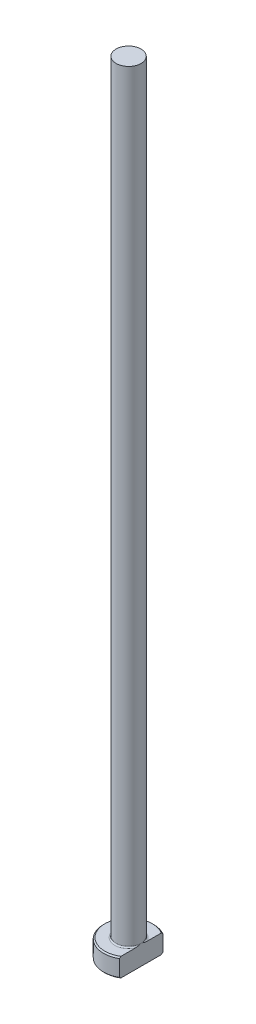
ISO-10303-21;
HEADER;
FILE_DESCRIPTION(('STEP AP214'),'2;1');
FILE_NAME('part.step','',(''),(''),'','','');
FILE_SCHEMA(('AUTOMOTIVE_DESIGN { 1 0 10303 214 1 1 1 1 }'));
ENDSEC;
DATA;
#1=APPLICATION_CONTEXT('core data for automotive mechanical design processes');
#2=APPLICATION_PROTOCOL_DEFINITION('international standard','automotive_design',2000,#1);
#3=PRODUCT_CONTEXT('',#1,'mechanical');
#4=PRODUCT('Part','Part','',(#3));
#5=PRODUCT_RELATED_PRODUCT_CATEGORY('part','',(#4));
#6=PRODUCT_DEFINITION_FORMATION('','',#4);
#7=PRODUCT_DEFINITION_CONTEXT('part definition',#1,'design');
#8=PRODUCT_DEFINITION('design','',#6,#7);
#9=PRODUCT_DEFINITION_SHAPE('','',#8);
#10=(LENGTH_UNIT() NAMED_UNIT(*) SI_UNIT(.MILLI.,.METRE.));
#11=(NAMED_UNIT(*) PLANE_ANGLE_UNIT() SI_UNIT($,.RADIAN.));
#12=(NAMED_UNIT(*) SI_UNIT($,.STERADIAN.) SOLID_ANGLE_UNIT());
#13=UNCERTAINTY_MEASURE_WITH_UNIT(LENGTH_MEASURE(1.E-05),#10,'distance_accuracy_value','');
#14=(GEOMETRIC_REPRESENTATION_CONTEXT(3) GLOBAL_UNCERTAINTY_ASSIGNED_CONTEXT((#13)) GLOBAL_UNIT_ASSIGNED_CONTEXT((#10,
#11,#12)) REPRESENTATION_CONTEXT('',''));
#15=CARTESIAN_POINT('',(0.,0.,0.));
#16=DIRECTION('',(0.,0.,1.));
#17=DIRECTION('',(1.,0.,0.));
#18=AXIS2_PLACEMENT_3D('',#15,#16,#17);
#19=CARTESIAN_POINT('',(0.,0.,0.));
#20=DIRECTION('',(0.,-1.,0.));
#21=DIRECTION('',(0.,0.,-1.));
#22=AXIS2_PLACEMENT_3D('',#19,#20,#21);
#23=PLANE('',#22);
#24=CARTESIAN_POINT('',(0.,0.,0.));
#25=DIRECTION('',(0.,-1.,0.));
#26=DIRECTION('',(0.,0.,-1.));
#27=AXIS2_PLACEMENT_3D('',#24,#25,#26);
#28=CIRCLE('',#27,3.79999999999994);
#29=CARTESIAN_POINT('',(1.99999999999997,0.,3.23109888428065));
#30=VERTEX_POINT('',#29);
#31=CARTESIAN_POINT('',(1.99999999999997,0.,-3.23109888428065));
#32=VERTEX_POINT('',#31);
#33=EDGE_CURVE('E98',#30,#32,#28,.T.);
#34=ORIENTED_EDGE('',*,*,#33,.T.);
#35=DIRECTION('',(0.,0.,1.));
#36=VECTOR('',#35,1.);
#37=CARTESIAN_POINT('',(1.99999999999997,0.,-3.46410161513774));
#38=LINE('',#37,#36);
#39=EDGE_CURVE('E83',#32,#30,#38,.T.);
#40=ORIENTED_EDGE('',*,*,#39,.T.);
#41=EDGE_LOOP('',(#34,#40));
#42=FACE_BOUND('',#41,.T.);
#43=ADVANCED_FACE('F32',(#42),#23,.T.);
#44=CARTESIAN_POINT('',(0.,259.958771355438,0.));
#45=DIRECTION('',(0.,1.,0.));
#46=DIRECTION('',(0.,0.,1.));
#47=AXIS2_PLACEMENT_3D('',#44,#45,#46);
#48=CYLINDRICAL_SURFACE('',#47,3.99999999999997);
#49=CARTESIAN_POINT('',(0.,2.79999999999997,0.));
#50=DIRECTION('',(0.,1.,0.));
#51=DIRECTION('',(0.,0.,1.));
#52=AXIS2_PLACEMENT_3D('',#49,#50,#51);
#53=CIRCLE('',#52,3.99999999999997);
#54=CARTESIAN_POINT('',(1.99999999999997,2.79999999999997,3.46410161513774));
#55=VERTEX_POINT('',#54);
#56=CARTESIAN_POINT('',(1.99999999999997,2.79999999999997,-3.46410161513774));
#57=VERTEX_POINT('',#56);
#58=EDGE_CURVE('E104',#55,#57,#53,.F.);
#59=ORIENTED_EDGE('',*,*,#58,.T.);
#60=DIRECTION('',(0.,-1.,0.));
#61=VECTOR('',#60,1.);
#62=CARTESIAN_POINT('',(1.99999999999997,125.,-3.46410161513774));
#63=LINE('',#62,#61);
#64=CARTESIAN_POINT('',(1.99999999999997,0.200000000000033,-3.46410161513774));
#65=VERTEX_POINT('',#64);
#66=EDGE_CURVE('E183',#57,#65,#63,.T.);
#67=ORIENTED_EDGE('',*,*,#66,.T.);
#68=CARTESIAN_POINT('',(0.,0.200000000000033,0.));
#69=DIRECTION('',(0.,-1.,0.));
#70=DIRECTION('',(0.,0.,-1.));
#71=AXIS2_PLACEMENT_3D('',#68,#69,#70);
#72=CIRCLE('',#71,3.99999999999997);
#73=CARTESIAN_POINT('',(1.99999999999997,0.200000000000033,3.46410161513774));
#74=VERTEX_POINT('',#73);
#75=EDGE_CURVE('E100',#65,#74,#72,.F.);
#76=ORIENTED_EDGE('',*,*,#75,.T.);
#77=DIRECTION('',(0.,-1.,0.));
#78=VECTOR('',#77,1.);
#79=CARTESIAN_POINT('',(1.99999999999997,125.,3.46410161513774));
#80=LINE('',#79,#78);
#81=EDGE_CURVE('E93',#55,#74,#80,.T.);
#82=ORIENTED_EDGE('',*,*,#81,.F.);
#83=EDGE_LOOP('',(#59,#67,#76,#82));
#84=FACE_BOUND('',#83,.T.);
#85=ADVANCED_FACE('F158',(#84),#48,.T.);
#86=CARTESIAN_POINT('',(-3.99999999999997,3.,0.));
#87=DIRECTION('',(0.,1.,0.));
#88=DIRECTION('',(0.,0.,1.));
#89=AXIS2_PLACEMENT_3D('',#86,#87,#88);
#90=PLANE('',#89);
#91=CARTESIAN_POINT('',(0.,3.,0.));
#92=DIRECTION('',(0.,1.,0.));
#93=DIRECTION('',(0.,0.,1.));
#94=AXIS2_PLACEMENT_3D('',#91,#92,#93);
#95=CIRCLE('',#94,3.79999999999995);
#96=CARTESIAN_POINT('',(1.99999999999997,3.,-3.23109888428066));
#97=VERTEX_POINT('',#96);
#98=CARTESIAN_POINT('',(1.99999999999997,3.,3.23109888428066));
#99=VERTEX_POINT('',#98);
#100=EDGE_CURVE('E178',#97,#99,#95,.T.);
#101=ORIENTED_EDGE('',*,*,#100,.T.);
#102=DIRECTION('',(0.,0.,-1.));
#103=VECTOR('',#102,1.);
#104=CARTESIAN_POINT('',(1.99999999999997,3.,0.));
#105=LINE('',#104,#103);
#106=CARTESIAN_POINT('',(1.99999999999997,2.99999999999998,0.916515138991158));
#107=VERTEX_POINT('',#106);
#108=EDGE_CURVE('E57',#99,#107,#105,.T.);
#109=ORIENTED_EDGE('',*,*,#108,.T.);
#110=CARTESIAN_POINT('',(0.,3.,0.));
#111=DIRECTION('',(0.,1.,0.));
#112=DIRECTION('',(0.,0.,1.));
#113=AXIS2_PLACEMENT_3D('',#110,#111,#112);
#114=CIRCLE('',#113,2.19999999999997);
#115=CARTESIAN_POINT('',(1.99999999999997,2.99999999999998,-0.9165151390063));
#116=VERTEX_POINT('',#115);
#117=EDGE_CURVE('E107',#107,#116,#114,.F.);
#118=ORIENTED_EDGE('',*,*,#117,.T.);
#119=EDGE_CURVE('E136',#116,#97,#105,.T.);
#120=ORIENTED_EDGE('',*,*,#119,.T.);
#121=EDGE_LOOP('',(#101,#109,#118,#120));
#122=FACE_BOUND('',#121,.T.);
#123=ADVANCED_FACE('F147',(#122),#90,.T.);
#124=CARTESIAN_POINT('',(0.,3.,0.));
#125=DIRECTION('',(0.,-1.,0.));
#126=DIRECTION('',(0.,0.,-1.));
#127=AXIS2_PLACEMENT_3D('',#124,#125,#126);
#128=CONICAL_SURFACE('',#127,3.79999999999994,0.785398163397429);
#129=ORIENTED_EDGE('',*,*,#58,.F.);
#130=CARTESIAN_POINT('',(1.99999999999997,-1.08095467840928,7.62295524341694));
#131=CARTESIAN_POINT('',(1.99999999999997,-0.913887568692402,7.45022392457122));
#132=CARTESIAN_POINT('',(1.99999999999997,-0.746999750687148,7.27731861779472));
#133=CARTESIAN_POINT('',(1.99999999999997,-0.413688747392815,6.93105655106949));
#134=CARTESIAN_POINT('',(1.99999999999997,-0.247265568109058,6.75769978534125));
#135=CARTESIAN_POINT('',(1.99999999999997,0.0850908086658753,6.41034692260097));
#136=CARTESIAN_POINT('',(1.99999999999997,0.251023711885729,6.23635054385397));
#137=CARTESIAN_POINT('',(1.99999999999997,0.582155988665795,5.88766284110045));
#138=CARTESIAN_POINT('',(1.99999999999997,0.747355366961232,5.71297152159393));
#139=CARTESIAN_POINT('',(1.99999999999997,1.07353855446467,5.36616839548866));
#140=CARTESIAN_POINT('',(1.99999999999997,1.23454099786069,5.194074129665));
#141=CARTESIAN_POINT('',(1.99999999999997,1.5553410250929,4.84876663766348));
#142=CARTESIAN_POINT('',(1.99999999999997,1.71513861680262,4.67555341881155));
#143=CARTESIAN_POINT('',(1.99999999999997,2.03306183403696,4.32766569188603));
#144=CARTESIAN_POINT('',(1.99999999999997,2.19118781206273,4.15299150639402));
#145=CARTESIAN_POINT('',(1.99999999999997,2.50513944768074,3.80159134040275));
#146=CARTESIAN_POINT('',(1.99999999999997,2.6609651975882,3.62486544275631));
#147=CARTESIAN_POINT('',(1.99999999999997,2.90974646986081,3.33722425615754));
#148=CARTESIAN_POINT('',(1.99999999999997,3.00376148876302,3.22722645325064));
#149=CARTESIAN_POINT('',(1.99999999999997,3.19011825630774,3.00579987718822));
#150=CARTESIAN_POINT('',(1.99999999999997,3.28245983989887,2.89437096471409));
#151=CARTESIAN_POINT('',(1.99999999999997,3.46586188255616,2.66849662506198));
#152=CARTESIAN_POINT('',(1.99999999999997,3.55689849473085,2.55403176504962));
#153=CARTESIAN_POINT('',(1.99999999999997,3.73578809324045,2.32266819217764));
#154=CARTESIAN_POINT('',(1.99999999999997,3.82364184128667,2.20577007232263));
#155=CARTESIAN_POINT('',(1.99999999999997,3.99612756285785,1.96688707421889));
#156=CARTESIAN_POINT('',(1.99999999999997,4.08069035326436,1.84485190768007));
#157=CARTESIAN_POINT('',(1.99999999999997,4.24300264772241,1.59599329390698));
#158=CARTESIAN_POINT('',(1.99999999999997,4.32074277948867,1.46916359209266));
#159=CARTESIAN_POINT('',(1.99999999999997,4.42869763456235,1.27510066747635));
#160=CARTESIAN_POINT('',(1.99999999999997,4.46305374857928,1.21018943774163));
#161=CARTESIAN_POINT('',(1.99999999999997,4.52837146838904,1.07868835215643));
#162=CARTESIAN_POINT('',(1.99999999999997,4.55933245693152,1.01209819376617));
#163=CARTESIAN_POINT('',(1.99999999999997,4.64566860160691,0.809894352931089));
#164=CARTESIAN_POINT('',(1.99999999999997,4.69478214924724,0.67136024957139));
#165=CARTESIAN_POINT('',(1.99999999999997,4.74794829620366,0.463657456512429));
#166=CARTESIAN_POINT('',(1.99999999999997,4.76205065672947,0.397033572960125));
#167=CARTESIAN_POINT('',(1.99999999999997,4.7839037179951,0.262728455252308));
#168=CARTESIAN_POINT('',(1.99999999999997,4.79165498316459,0.195047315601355));
#169=CARTESIAN_POINT('',(1.99999999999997,4.80025690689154,0.0594528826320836));
#170=CARTESIAN_POINT('',(1.99999999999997,4.80112894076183,-0.00845903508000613));
#171=CARTESIAN_POINT('',(1.99999999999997,4.79596585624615,-0.144020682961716));
#172=CARTESIAN_POINT('',(1.99999999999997,4.7899301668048,-0.211670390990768));
#173=CARTESIAN_POINT('',(1.99999999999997,4.77145363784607,-0.34548399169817));
#174=CARTESIAN_POINT('',(1.99999999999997,4.75906777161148,-0.411655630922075));
#175=CARTESIAN_POINT('',(1.99999999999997,4.72866360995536,-0.542678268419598));
#176=CARTESIAN_POINT('',(1.99999999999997,4.71064463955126,-0.607529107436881));
#177=CARTESIAN_POINT('',(1.99999999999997,4.66972939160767,-0.736064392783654));
#178=CARTESIAN_POINT('',(1.99999999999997,4.6468056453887,-0.799739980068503));
#179=CARTESIAN_POINT('',(1.99999999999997,4.59700147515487,-0.925489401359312));
#180=CARTESIAN_POINT('',(1.99999999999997,4.57012185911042,-0.98756355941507));
#181=CARTESIAN_POINT('',(1.99999999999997,4.48443518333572,-1.17209020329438));
#182=CARTESIAN_POINT('',(1.99999999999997,4.42077407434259,-1.29228210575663));
#183=CARTESIAN_POINT('',(1.99999999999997,4.28502644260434,-1.52785770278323));
#184=CARTESIAN_POINT('',(1.99999999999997,4.21292931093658,-1.64323509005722));
#185=CARTESIAN_POINT('',(1.99999999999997,4.0628151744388,-1.87069387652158));
#186=CARTESIAN_POINT('',(1.99999999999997,3.98477595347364,-1.98276048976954));
#187=CARTESIAN_POINT('',(1.99999999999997,3.82481971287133,-2.20397837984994));
#188=CARTESIAN_POINT('',(1.99999999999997,3.74290465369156,-2.31313108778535));
#189=CARTESIAN_POINT('',(1.99999999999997,3.57517222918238,-2.5306854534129));
#190=CARTESIAN_POINT('',(1.99999999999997,3.48931769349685,-2.63905831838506));
#191=CARTESIAN_POINT('',(1.99999999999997,3.31548151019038,-2.85409686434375));
#192=CARTESIAN_POINT('',(1.99999999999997,3.22749963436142,-2.96076236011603));
#193=CARTESIAN_POINT('',(1.99999999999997,3.05015030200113,-3.17249211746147));
#194=CARTESIAN_POINT('',(1.99999999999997,2.96078672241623,-3.27755963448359));
#195=CARTESIAN_POINT('',(1.99999999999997,2.78082366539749,-3.48663191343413));
#196=CARTESIAN_POINT('',(1.99999999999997,2.69022416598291,-3.59063665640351));
#197=CARTESIAN_POINT('',(1.99999999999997,2.4479673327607,-3.86612439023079));
#198=CARTESIAN_POINT('',(1.99999999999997,2.29545972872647,-4.03685912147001));
#199=CARTESIAN_POINT('',(1.99999999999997,1.98858070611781,-4.37664803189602));
#200=CARTESIAN_POINT('',(1.99999999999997,1.8342092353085,-4.54570216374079));
#201=CARTESIAN_POINT('',(1.99999999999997,1.52396102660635,-4.88271638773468));
#202=CARTESIAN_POINT('',(1.99999999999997,1.3680830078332,-5.05067529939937));
#203=CARTESIAN_POINT('',(1.99999999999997,1.05530513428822,-5.38563883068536));
#204=CARTESIAN_POINT('',(1.99999999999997,0.898405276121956,-5.55264344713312));
#205=CARTESIAN_POINT('',(1.99999999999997,0.590290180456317,-5.87905385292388));
#206=CARTESIAN_POINT('',(1.99999999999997,0.439106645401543,-6.03848959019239));
#207=CARTESIAN_POINT('',(1.99999999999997,0.136164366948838,-6.356814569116));
#208=CARTESIAN_POINT('',(1.99999999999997,-0.0155943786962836,-6.51570380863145));
#209=CARTESIAN_POINT('',(1.99999999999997,-0.31940498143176,-6.83286192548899));
#210=CARTESIAN_POINT('',(1.99999999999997,-0.471456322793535,-6.99113129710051));
#211=CARTESIAN_POINT('',(1.99999999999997,-0.77593964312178,-7.30730102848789));
#212=CARTESIAN_POINT('',(1.99999999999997,-0.928371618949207,-7.46520139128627));
#213=CARTESIAN_POINT('',(1.99999999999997,-1.08095467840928,-7.62295524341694));
#214=B_SPLINE_CURVE_WITH_KNOTS('',3,(#130,#131,#132,#133,#134,#135,#136,#137,#138,#139,#140,
#141,#142,#143,#144,#145,#146,#147,#148,#149,#150,#151,#152,#153,#154,#155,#156,#157,#158,#159,
#160,#161,#162,#163,#164,#165,#166,#167,#168,#169,#170,#171,#172,#173,#174,#175,#176,#177,#178,
#179,#180,#181,#182,#183,#184,#185,#186,#187,#188,#189,#190,#191,#192,#193,#194,#195,#196,#197,
#198,#199,#200,#201,#202,#203,#204,#205,#206,#207,#208,#209,#210,#211,#212,#213),.UNSPECIFIED.,
.F.,.F.,(4,2,2,2,2,2,2,2,2,2,2,2,2,2,2,2,2,2,2,2,2,2,2,2,2,2,2,2,2,2,2,2,2,2,2,2,2,2,2,2,2,4),
(0.,0.720921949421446,1.44185317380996,2.1631532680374,2.88444869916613,3.59144103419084,
4.29842874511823,5.005264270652,5.712071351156,6.14616174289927,6.58029471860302,
7.01901494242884,7.45762947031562,7.90290456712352,8.34878206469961,8.56901415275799,
8.7892862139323,9.22814472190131,9.43219512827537,9.63622739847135,9.8396254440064,
10.0430403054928,10.2447232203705,10.4464303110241,10.6492980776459,10.8521244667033,
11.259558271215,11.6675100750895,12.0770700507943,12.4864250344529,12.901167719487,
13.3159550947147,13.7297367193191,14.1435257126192,14.8302935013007,15.5170805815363,
16.2045145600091,16.8919508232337,17.5511045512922,18.2102608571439,18.86868195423,
19.5270976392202),.UNSPECIFIED.);
#215=EDGE_CURVE('E135',#55,#99,#214,.T.);
#216=ORIENTED_EDGE('',*,*,#215,.T.);
#217=ORIENTED_EDGE('',*,*,#100,.F.);
#218=EDGE_CURVE('E127',#97,#57,#214,.T.);
#219=ORIENTED_EDGE('',*,*,#218,.T.);
#220=EDGE_LOOP('',(#129,#216,#217,#219));
#221=FACE_BOUND('',#220,.T.);
#222=ADVANCED_FACE('F143',(#221),#128,.T.);
#223=CARTESIAN_POINT('',(0.,0.200000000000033,0.));
#224=DIRECTION('',(0.,1.,0.));
#225=DIRECTION('',(0.,0.,1.));
#226=AXIS2_PLACEMENT_3D('',#223,#224,#225);
#227=CONICAL_SURFACE('',#226,3.99999999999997,0.785398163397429);
#228=ORIENTED_EDGE('',*,*,#75,.F.);
#229=CARTESIAN_POINT('',(1.99999999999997,4.08095467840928,-7.62295524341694));
#230=CARTESIAN_POINT('',(1.99999999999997,3.91388756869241,-7.45022392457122));
#231=CARTESIAN_POINT('',(1.99999999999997,3.74699975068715,-7.27731861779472));
#232=CARTESIAN_POINT('',(1.99999999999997,3.41368874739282,-6.9310565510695));
#233=CARTESIAN_POINT('',(1.99999999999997,3.24726556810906,-6.75769978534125));
#234=CARTESIAN_POINT('',(1.99999999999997,2.91490919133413,-6.41034692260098));
#235=CARTESIAN_POINT('',(1.99999999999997,2.74897628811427,-6.23635054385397));
#236=CARTESIAN_POINT('',(1.99999999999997,2.41784401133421,-5.88766284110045));
#237=CARTESIAN_POINT('',(1.99999999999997,2.25264463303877,-5.71297152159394));
#238=CARTESIAN_POINT('',(1.99999999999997,1.92646144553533,-5.36616839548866));
#239=CARTESIAN_POINT('',(1.99999999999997,1.76545900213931,-5.19407412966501));
#240=CARTESIAN_POINT('',(1.99999999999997,1.4446589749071,-4.84876663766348));
#241=CARTESIAN_POINT('',(1.99999999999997,1.28486138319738,-4.67555341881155));
#242=CARTESIAN_POINT('',(1.99999999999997,0.966938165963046,-4.32766569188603));
#243=CARTESIAN_POINT('',(1.99999999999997,0.808812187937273,-4.15299150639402));
#244=CARTESIAN_POINT('',(1.99999999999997,0.494860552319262,-3.80159134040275));
#245=CARTESIAN_POINT('',(1.99999999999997,0.339034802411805,-3.62486544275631));
#246=CARTESIAN_POINT('',(1.99999999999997,0.0902535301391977,-3.33722425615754));
#247=CARTESIAN_POINT('',(1.99999999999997,-0.00376148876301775,-3.22722645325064));
#248=CARTESIAN_POINT('',(1.99999999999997,-0.190118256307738,-3.00579987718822));
#249=CARTESIAN_POINT('',(1.99999999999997,-0.282459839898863,-2.89437096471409));
#250=CARTESIAN_POINT('',(1.99999999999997,-0.465861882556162,-2.66849662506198));
#251=CARTESIAN_POINT('',(1.99999999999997,-0.556898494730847,-2.55403176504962));
#252=CARTESIAN_POINT('',(1.99999999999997,-0.735788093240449,-2.32266819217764));
#253=CARTESIAN_POINT('',(1.99999999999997,-0.823641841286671,-2.20577007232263));
#254=CARTESIAN_POINT('',(1.99999999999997,-0.996127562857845,-1.96688707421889));
#255=CARTESIAN_POINT('',(1.99999999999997,-1.08069035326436,-1.84485190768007));
#256=CARTESIAN_POINT('',(1.99999999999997,-1.2430026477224,-1.59599329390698));
#257=CARTESIAN_POINT('',(1.99999999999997,-1.32074277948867,-1.46916359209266));
#258=CARTESIAN_POINT('',(1.99999999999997,-1.42869763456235,-1.27510066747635));
#259=CARTESIAN_POINT('',(1.99999999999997,-1.46305374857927,-1.21018943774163));
#260=CARTESIAN_POINT('',(1.99999999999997,-1.52837146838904,-1.07868835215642));
#261=CARTESIAN_POINT('',(1.99999999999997,-1.55933245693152,-1.01209819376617));
#262=CARTESIAN_POINT('',(1.99999999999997,-1.64566860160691,-0.809894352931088));
#263=CARTESIAN_POINT('',(1.99999999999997,-1.69478214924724,-0.671360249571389));
#264=CARTESIAN_POINT('',(1.99999999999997,-1.74794829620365,-0.463657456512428));
#265=CARTESIAN_POINT('',(1.99999999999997,-1.76205065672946,-0.397033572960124));
#266=CARTESIAN_POINT('',(1.99999999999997,-1.7839037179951,-0.262728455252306));
#267=CARTESIAN_POINT('',(1.99999999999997,-1.79165498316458,-0.195047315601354));
#268=CARTESIAN_POINT('',(1.99999999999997,-1.80025690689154,-0.0594528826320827));
#269=CARTESIAN_POINT('',(1.99999999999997,-1.80112894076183,0.00845903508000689));
#270=CARTESIAN_POINT('',(1.99999999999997,-1.79596585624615,0.144020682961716));
#271=CARTESIAN_POINT('',(1.99999999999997,-1.7899301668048,0.211670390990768));
#272=CARTESIAN_POINT('',(1.99999999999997,-1.77145363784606,0.345483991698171));
#273=CARTESIAN_POINT('',(1.99999999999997,-1.75906777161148,0.411655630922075));
#274=CARTESIAN_POINT('',(1.99999999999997,-1.72866360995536,0.542678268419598));
#275=CARTESIAN_POINT('',(1.99999999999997,-1.71064463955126,0.60752910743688));
#276=CARTESIAN_POINT('',(1.99999999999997,-1.66972939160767,0.736064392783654));
#277=CARTESIAN_POINT('',(1.99999999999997,-1.6468056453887,0.799739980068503));
#278=CARTESIAN_POINT('',(1.99999999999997,-1.59700147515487,0.925489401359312));
#279=CARTESIAN_POINT('',(1.99999999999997,-1.57012185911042,0.98756355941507));
#280=CARTESIAN_POINT('',(1.99999999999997,-1.48443518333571,1.17209020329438));
#281=CARTESIAN_POINT('',(1.99999999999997,-1.42077407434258,1.29228210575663));
#282=CARTESIAN_POINT('',(1.99999999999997,-1.28502644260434,1.52785770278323));
#283=CARTESIAN_POINT('',(1.99999999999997,-1.21292931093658,1.64323509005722));
#284=CARTESIAN_POINT('',(1.99999999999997,-1.0628151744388,1.87069387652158));
#285=CARTESIAN_POINT('',(1.99999999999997,-0.984775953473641,1.98276048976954));
#286=CARTESIAN_POINT('',(1.99999999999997,-0.824819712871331,2.20397837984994));
#287=CARTESIAN_POINT('',(1.99999999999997,-0.742904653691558,2.31313108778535));
#288=CARTESIAN_POINT('',(1.99999999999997,-0.575172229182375,2.53068545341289));
#289=CARTESIAN_POINT('',(1.99999999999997,-0.489317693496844,2.63905831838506));
#290=CARTESIAN_POINT('',(1.99999999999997,-0.315481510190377,2.85409686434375));
#291=CARTESIAN_POINT('',(1.99999999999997,-0.227499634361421,2.96076236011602));
#292=CARTESIAN_POINT('',(1.99999999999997,-0.0501503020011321,3.17249211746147));
#293=CARTESIAN_POINT('',(1.99999999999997,0.0392132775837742,3.27755963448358));
#294=CARTESIAN_POINT('',(1.99999999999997,0.219176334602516,3.48663191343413));
#295=CARTESIAN_POINT('',(1.99999999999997,0.309775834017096,3.59063665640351));
#296=CARTESIAN_POINT('',(1.99999999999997,0.552032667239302,3.86612439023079));
#297=CARTESIAN_POINT('',(1.99999999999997,0.704540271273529,4.03685912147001));
#298=CARTESIAN_POINT('',(1.99999999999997,1.01141929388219,4.37664803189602));
#299=CARTESIAN_POINT('',(1.99999999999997,1.1657907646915,4.54570216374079));
#300=CARTESIAN_POINT('',(1.99999999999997,1.47603897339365,4.88271638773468));
#301=CARTESIAN_POINT('',(1.99999999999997,1.63191699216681,5.05067529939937));
#302=CARTESIAN_POINT('',(1.99999999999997,1.94469486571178,5.38563883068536));
#303=CARTESIAN_POINT('',(1.99999999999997,2.10159472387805,5.55264344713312));
#304=CARTESIAN_POINT('',(1.99999999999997,2.40970981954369,5.87905385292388));
#305=CARTESIAN_POINT('',(1.99999999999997,2.56089335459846,6.03848959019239));
#306=CARTESIAN_POINT('',(1.99999999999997,2.86383563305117,6.356814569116));
#307=CARTESIAN_POINT('',(1.99999999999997,3.01559437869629,6.51570380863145));
#308=CARTESIAN_POINT('',(1.99999999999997,3.31940498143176,6.83286192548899));
#309=CARTESIAN_POINT('',(1.99999999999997,3.47145632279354,6.99113129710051));
#310=CARTESIAN_POINT('',(1.99999999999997,3.77593964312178,7.30730102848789));
#311=CARTESIAN_POINT('',(1.99999999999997,3.92837161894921,7.46520139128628));
#312=CARTESIAN_POINT('',(1.99999999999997,4.08095467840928,7.62295524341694));
#313=B_SPLINE_CURVE_WITH_KNOTS('',3,(#229,#230,#231,#232,#233,#234,#235,#236,#237,#238,#239,
#240,#241,#242,#243,#244,#245,#246,#247,#248,#249,#250,#251,#252,#253,#254,#255,#256,#257,#258,
#259,#260,#261,#262,#263,#264,#265,#266,#267,#268,#269,#270,#271,#272,#273,#274,#275,#276,#277,
#278,#279,#280,#281,#282,#283,#284,#285,#286,#287,#288,#289,#290,#291,#292,#293,#294,#295,#296,
#297,#298,#299,#300,#301,#302,#303,#304,#305,#306,#307,#308,#309,#310,#311,#312),.UNSPECIFIED.,
.F.,.F.,(4,2,2,2,2,2,2,2,2,2,2,2,2,2,2,2,2,2,2,2,2,2,2,2,2,2,2,2,2,2,2,2,2,2,2,2,2,2,2,2,2,4),
(0.,0.720921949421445,1.44185317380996,2.1631532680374,2.88444869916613,3.59144103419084,
4.29842874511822,5.005264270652,5.71207135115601,6.14616174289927,6.58029471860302,
7.01901494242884,7.45762947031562,7.90290456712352,8.34878206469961,8.56901415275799,
8.7892862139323,9.22814472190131,9.43219512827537,9.63622739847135,9.8396254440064,
10.0430403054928,10.2447232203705,10.4464303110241,10.6492980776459,10.8521244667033,
11.259558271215,11.6675100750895,12.0770700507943,12.4864250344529,12.901167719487,
13.3159550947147,13.7297367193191,14.1435257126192,14.8302935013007,15.5170805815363,
16.2045145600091,16.8919508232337,17.5511045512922,18.2102608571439,18.86868195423,
19.5270976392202),.UNSPECIFIED.);
#314=EDGE_CURVE('E86',#65,#32,#313,.T.);
#315=ORIENTED_EDGE('',*,*,#314,.T.);
#316=ORIENTED_EDGE('',*,*,#33,.F.);
#317=EDGE_CURVE('E89',#30,#74,#313,.T.);
#318=ORIENTED_EDGE('',*,*,#317,.T.);
#319=EDGE_LOOP('',(#228,#315,#316,#318));
#320=FACE_BOUND('',#319,.T.);
#321=ADVANCED_FACE('F97',(#320),#227,.T.);
#322=CARTESIAN_POINT('',(0.,3.19999999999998,0.));
#323=DIRECTION('',(0.,1.,0.));
#324=DIRECTION('',(0.,0.,1.));
#325=AXIS2_PLACEMENT_3D('',#322,#323,#324);
#326=TOROIDAL_SURFACE('',#325,2.19999999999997,0.2);
#327=CARTESIAN_POINT('',(1.99999999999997,3.19999999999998,0.));
#328=CARTESIAN_POINT('',(1.99999999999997,3.20000050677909,1.13930257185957E-10));
#329=CARTESIAN_POINT('',(1.99999999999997,3.20000101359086,-1.46766790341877E-07));
#330=CARTESIAN_POINT('',(1.99999999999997,3.20000197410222,-5.82067439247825E-07));
#331=CARTESIAN_POINT('',(1.99999999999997,3.20000242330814,-8.77873003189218E-07));
#332=CARTESIAN_POINT('',(1.99999999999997,3.20000333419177,-1.58424512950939E-06));
#333=CARTESIAN_POINT('',(1.99999999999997,3.20000378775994,-2.00534281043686E-06));
#334=CARTESIAN_POINT('',(1.99999999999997,3.20000462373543,-2.89558838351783E-06));
#335=CARTESIAN_POINT('',(1.99999999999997,3.20000500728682,-3.3637232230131E-06));
#336=CARTESIAN_POINT('',(1.99999999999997,3.20000636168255,-5.10887545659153E-06));
#337=CARTESIAN_POINT('',(1.99999999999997,3.2000072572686,-6.44597273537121E-06));
#338=CARTESIAN_POINT('',(1.99999999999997,3.20000879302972,-9.14926709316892E-06));
#339=CARTESIAN_POINT('',(1.99999999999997,3.20000944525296,-1.05089714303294E-05));
#340=CARTESIAN_POINT('',(1.99999999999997,3.20001204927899,-1.60555879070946E-05));
#341=CARTESIAN_POINT('',(1.99999999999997,3.20001390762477,-2.02908746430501E-05));
#342=CARTESIAN_POINT('',(1.99999999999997,3.20001676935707,-2.84438492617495E-05));
#343=CARTESIAN_POINT('',(1.99999999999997,3.2000178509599,-3.23343257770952E-05));
#344=CARTESIAN_POINT('',(1.99999999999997,3.20002551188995,-6.06027142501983E-05));
#345=CARTESIAN_POINT('',(1.99999999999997,3.20003111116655,-8.51991843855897E-05));
#346=CARTESIAN_POINT('',(1.99999999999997,3.20005559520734,-0.000181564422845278));
#347=CARTESIAN_POINT('',(1.99999999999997,3.20007914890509,-0.00025209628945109));
#348=CARTESIAN_POINT('',(1.99999999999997,3.20017002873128,-0.000529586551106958));
#349=CARTESIAN_POINT('',(1.99999999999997,3.20023415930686,-0.000737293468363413));
#350=CARTESIAN_POINT('',(1.99999999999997,3.20048926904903,-0.00155657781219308));
#351=CARTESIAN_POINT('',(1.99999999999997,3.20068414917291,-0.00216722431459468));
#352=CARTESIAN_POINT('',(1.99999999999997,3.20148805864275,-0.00469384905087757));
#353=CARTESIAN_POINT('',(1.99999999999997,3.20209226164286,-0.00661098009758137));
#354=CARTESIAN_POINT('',(1.99999999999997,3.20822779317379,-0.026069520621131));
#355=CARTESIAN_POINT('',(1.99999999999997,3.21378174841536,-0.0436057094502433));
#356=CARTESIAN_POINT('',(1.99999999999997,3.22462834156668,-0.0780127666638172));
#357=CARTESIAN_POINT('',(1.99999999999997,3.2299227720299,-0.0948831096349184));
#358=CARTESIAN_POINT('',(1.99999999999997,3.24110477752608,-0.130713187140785));
#359=CARTESIAN_POINT('',(1.99999999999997,3.24698536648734,-0.149675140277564));
#360=CARTESIAN_POINT('',(1.99999999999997,3.2586983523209,-0.187834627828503));
#361=CARTESIAN_POINT('',(1.99999999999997,3.26452957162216,-0.207032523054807));
#362=CARTESIAN_POINT('',(1.99999999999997,3.27861584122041,-0.254071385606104));
#363=CARTESIAN_POINT('',(1.99999999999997,3.28678835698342,-0.281937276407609));
#364=CARTESIAN_POINT('',(1.99999999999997,3.30249503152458,-0.337115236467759));
#365=CARTESIAN_POINT('',(1.99999999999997,3.31003989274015,-0.36442425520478));
#366=CARTESIAN_POINT('',(1.99999999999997,3.32554795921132,-0.422841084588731));
#367=CARTESIAN_POINT('',(1.99999999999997,3.33343288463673,-0.453970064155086));
#368=CARTESIAN_POINT('',(1.99999999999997,3.34833120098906,-0.516667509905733));
#369=CARTESIAN_POINT('',(1.99999999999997,3.3553379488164,-0.548237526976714));
#370=CARTESIAN_POINT('',(1.99999999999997,3.37554978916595,-0.647984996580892));
#371=CARTESIAN_POINT('',(1.99999999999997,3.38665117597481,-0.716635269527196));
#372=CARTESIAN_POINT('',(1.99999999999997,3.39785773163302,-0.832445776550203));
#373=CARTESIAN_POINT('',(1.99999999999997,3.40036304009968,-0.879345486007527));
#374=CARTESIAN_POINT('',(1.99999999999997,3.3997602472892,-0.94923898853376));
#375=CARTESIAN_POINT('',(1.99999999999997,3.39886048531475,-0.972248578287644));
#376=CARTESIAN_POINT('',(1.99999999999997,3.39534463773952,-1.01812773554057));
#377=CARTESIAN_POINT('',(1.99999999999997,3.39273014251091,-1.04099741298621));
#378=CARTESIAN_POINT('',(1.99999999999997,3.38623968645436,-1.08102660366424));
#379=CARTESIAN_POINT('',(1.99999999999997,3.38280841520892,-1.09825717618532));
#380=CARTESIAN_POINT('',(1.99999999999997,3.37442567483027,-1.13243508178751));
#381=CARTESIAN_POINT('',(1.99999999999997,3.36946777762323,-1.14938089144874));
#382=CARTESIAN_POINT('',(1.99999999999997,3.35764172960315,-1.18276398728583));
#383=CARTESIAN_POINT('',(1.99999999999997,3.3507581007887,-1.19919590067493));
#384=CARTESIAN_POINT('',(1.99999999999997,3.33462082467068,-1.23083581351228));
#385=CARTESIAN_POINT('',(1.99999999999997,3.32537783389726,-1.24604892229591));
#386=CARTESIAN_POINT('',(1.99999999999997,3.30929159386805,-1.26715296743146));
#387=CARTESIAN_POINT('',(1.99999999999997,3.30356769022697,-1.27389441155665));
#388=CARTESIAN_POINT('',(1.99999999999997,3.29128925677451,-1.28659894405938));
#389=CARTESIAN_POINT('',(1.99999999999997,3.28473413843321,-1.2925614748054));
#390=CARTESIAN_POINT('',(1.99999999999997,3.27066594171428,-1.30346436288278));
#391=CARTESIAN_POINT('',(1.99999999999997,3.26314132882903,-1.30839014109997));
#392=CARTESIAN_POINT('',(1.99999999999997,3.24727957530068,-1.31668687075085));
#393=CARTESIAN_POINT('',(1.99999999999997,3.23894498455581,-1.32006252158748));
#394=CARTESIAN_POINT('',(1.99999999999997,3.22424089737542,-1.3241557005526));
#395=CARTESIAN_POINT('',(1.99999999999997,3.21800630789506,-1.32536112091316));
#396=CARTESIAN_POINT('',(1.99999999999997,3.20542266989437,-1.32669615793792));
#397=CARTESIAN_POINT('',(1.99999999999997,3.19907368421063,-1.32682634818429));
#398=CARTESIAN_POINT('',(1.99999999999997,3.18645152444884,-1.32599950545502));
#399=CARTESIAN_POINT('',(1.99999999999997,3.18017831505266,-1.32504300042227));
#400=CARTESIAN_POINT('',(1.99999999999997,3.16787181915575,-1.32212308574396));
#401=CARTESIAN_POINT('',(1.99999999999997,3.16183869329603,-1.3201590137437));
#402=CARTESIAN_POINT('',(1.99999999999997,3.14844260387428,-1.3146656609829));
#403=CARTESIAN_POINT('',(1.99999999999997,3.14119825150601,-1.31084826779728));
#404=CARTESIAN_POINT('',(1.99999999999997,3.12742328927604,-1.30209252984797));
#405=CARTESIAN_POINT('',(1.99999999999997,3.12089414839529,-1.2971519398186));
#406=CARTESIAN_POINT('',(1.99999999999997,3.10554761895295,-1.28382084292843));
#407=CARTESIAN_POINT('',(1.99999999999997,3.09717242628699,-1.27492468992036));
#408=CARTESIAN_POINT('',(1.99999999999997,3.08188323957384,-1.25597903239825));
#409=CARTESIAN_POINT('',(1.99999999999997,3.07497120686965,-1.24592800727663));
#410=CARTESIAN_POINT('',(1.99999999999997,3.05771073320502,-1.21734573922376));
#411=CARTESIAN_POINT('',(1.99999999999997,3.04862251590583,-1.19806017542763));
#412=CARTESIAN_POINT('',(1.99999999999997,3.03323781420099,-1.15830155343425));
#413=CARTESIAN_POINT('',(1.99999999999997,3.02696471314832,-1.13782009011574));
#414=CARTESIAN_POINT('',(1.99999999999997,3.0165915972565,-1.09607450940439));
#415=CARTESIAN_POINT('',(1.99999999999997,3.0125177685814,-1.07480405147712));
#416=CARTESIAN_POINT('',(1.99999999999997,3.00618909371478,-1.03196822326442));
#417=CARTESIAN_POINT('',(1.99999999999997,3.00393768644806,-1.01040237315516));
#418=CARTESIAN_POINT('',(1.99999999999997,2.99950887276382,-0.94694819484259));
#419=CARTESIAN_POINT('',(1.99999999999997,2.99937097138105,-0.904921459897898));
#420=CARTESIAN_POINT('',(1.99999999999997,3.00391139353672,-0.800067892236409));
#421=CARTESIAN_POINT('',(1.99999999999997,3.01103947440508,-0.7373784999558));
#422=CARTESIAN_POINT('',(1.99999999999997,3.0310998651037,-0.611444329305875));
#423=CARTESIAN_POINT('',(1.99999999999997,3.04417074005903,-0.548223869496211));
#424=CARTESIAN_POINT('',(1.99999999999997,3.06920011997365,-0.442888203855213));
#425=CARTESIAN_POINT('',(1.99999999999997,3.08016343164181,-0.40052705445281));
#426=CARTESIAN_POINT('',(1.99999999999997,3.10315303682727,-0.316588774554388));
#427=CARTESIAN_POINT('',(1.99999999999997,3.11516655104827,-0.275008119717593));
#428=CARTESIAN_POINT('',(1.99999999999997,3.13853403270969,-0.196672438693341));
#429=CARTESIAN_POINT('',(1.99999999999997,3.14981294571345,-0.159894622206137));
#430=CARTESIAN_POINT('',(1.99999999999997,3.17316886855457,-0.0849211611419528));
#431=CARTESIAN_POINT('',(1.99999999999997,3.1852595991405,-0.0467297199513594));
#432=CARTESIAN_POINT('',(1.99999999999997,3.19790869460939,-0.00660765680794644));
#433=CARTESIAN_POINT('',(1.99999999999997,3.19851400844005,-0.00468723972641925));
#434=CARTESIAN_POINT('',(1.99999999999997,3.19931818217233,-0.00215985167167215));
#435=CARTESIAN_POINT('',(1.99999999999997,3.19951225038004,-0.00155173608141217));
#436=CARTESIAN_POINT('',(1.99999999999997,3.19976637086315,-0.000735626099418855));
#437=CARTESIAN_POINT('',(1.99999999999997,3.19983030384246,-0.000528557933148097));
#438=CARTESIAN_POINT('',(1.99999999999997,3.1999209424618,-0.000251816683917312));
#439=CARTESIAN_POINT('',(1.99999999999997,3.19994446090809,-0.000181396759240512));
#440=CARTESIAN_POINT('',(1.99999999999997,3.19996891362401,-8.51622335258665E-05));
#441=CARTESIAN_POINT('',(1.99999999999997,3.19997450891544,-6.05824642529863E-05));
#442=CARTESIAN_POINT('',(1.99999999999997,3.19998216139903,-3.23308900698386E-05));
#443=CARTESIAN_POINT('',(1.99999999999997,3.19998324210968,-2.8441435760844E-05));
#444=CARTESIAN_POINT('',(1.99999999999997,3.19998610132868,-2.02904708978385E-05));
#445=CARTESIAN_POINT('',(1.99999999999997,3.19998795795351,-1.60561197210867E-05));
#446=CARTESIAN_POINT('',(1.99999999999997,3.19999055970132,-1.05104410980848E-05));
#447=CARTESIAN_POINT('',(1.99999999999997,3.19999121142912,-9.15081310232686E-06));
#448=CARTESIAN_POINT('',(1.99999999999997,3.19999274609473,-6.44758190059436E-06));
#449=CARTESIAN_POINT('',(1.99999999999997,3.19999364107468,-5.11046368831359E-06));
#450=CARTESIAN_POINT('',(1.99999999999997,3.19999499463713,-3.36517633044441E-06));
#451=CARTESIAN_POINT('',(1.99999999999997,3.19999537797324,-2.89697952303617E-06));
#452=CARTESIAN_POINT('',(1.99999999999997,3.19999621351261,-2.00657123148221E-06));
#453=CARTESIAN_POINT('',(1.99999999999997,3.19999666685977,-1.58537194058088E-06));
#454=CARTESIAN_POINT('',(1.99999999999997,3.19999757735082,-8.78757202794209E-07));
#455=CARTESIAN_POINT('',(1.99999999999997,3.19999802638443,-5.82817881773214E-07));
#456=CARTESIAN_POINT('',(1.99999999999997,3.19999898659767,-1.47186730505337E-07));
#457=CARTESIAN_POINT('',(1.99999999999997,3.1999994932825,-1.13916400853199E-10));
#458=CARTESIAN_POINT('',(1.99999999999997,3.19999999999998,0.));
#459=B_SPLINE_CURVE_WITH_KNOTS('',3,(#327,#328,#329,#330,#331,#332,#333,#334,#335,#336,#337,
#338,#339,#340,#341,#342,#343,#344,#345,#346,#347,#348,#349,#350,#351,#352,#353,#354,#355,#356,
#357,#358,#359,#360,#361,#362,#363,#364,#365,#366,#367,#368,#369,#370,#371,#372,#373,#374,#375,
#376,#377,#378,#379,#380,#381,#382,#383,#384,#385,#386,#387,#388,#389,#390,#391,#392,#393,#394,
#395,#396,#397,#398,#399,#400,#401,#402,#403,#404,#405,#406,#407,#408,#409,#410,#411,#412,#413,
#414,#415,#416,#417,#418,#419,#420,#421,#422,#423,#424,#425,#426,#427,#428,#429,#430,#431,#432,
#433,#434,#435,#436,#437,#438,#439,#440,#441,#442,#443,#444,#445,#446,#447,#448,#449,#450,#451,
#452,#453,#454,#455,#456,#457,#458),.UNSPECIFIED.,.T.,.F.,(4,2,2,2,2,2,2,2,2,2,2,2,2,2,2,2,2,2,
2,2,2,2,2,2,2,2,2,2,2,2,2,2,2,2,2,2,2,2,2,2,2,2,2,2,2,2,2,2,2,2,2,2,2,2,2,2,2,2,2,2,2,2,2,2,2,
4),(0.,1.5236988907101E-06,3.13175187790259E-06,4.97933886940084E-06,6.79332734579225E-06,
1.1600592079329E-05,1.61211192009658E-05,2.99630987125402E-05,4.20611843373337E-05,
0.000117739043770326,0.000340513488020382,0.000992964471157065,0.00291555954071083,
0.00894623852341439,0.0641278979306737,0.117173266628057,0.176731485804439,0.236923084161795,
0.324038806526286,0.409031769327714,0.50535329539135,0.602364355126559,0.810598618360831,
0.951214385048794,1.0202479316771,1.08921754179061,1.14187257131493,1.19475241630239,
1.24807013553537,1.30115116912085,1.32762610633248,1.35411989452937,1.38096446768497,
1.40772711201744,1.42669285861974,1.44564848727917,1.46459491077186,1.48355380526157,
1.50798338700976,1.5324622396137,1.56891061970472,1.60540755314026,1.66900939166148,
1.73313017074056,1.79799846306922,1.86298887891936,1.98877684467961,2.17764082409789,
2.37115413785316,2.50240556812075,2.632237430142,2.74764208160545,2.86781494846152,
2.87385601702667,2.87577064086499,2.87642108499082,2.87664350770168,2.87671913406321,
2.87673122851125,2.87674506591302,2.87674958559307,2.87675439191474,2.87675620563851,
2.87675805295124,2.87675966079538,2.87676118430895),.UNSPECIFIED.);
#460=CARTESIAN_POINT('',(1.99999999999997,3.19999999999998,0.));
#461=VERTEX_POINT('',#460);
#462=EDGE_CURVE('E11',#116,#461,#459,.T.);
#463=ORIENTED_EDGE('',*,*,#462,.F.);
#464=ORIENTED_EDGE('',*,*,#117,.F.);
#465=CARTESIAN_POINT('',(1.99999999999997,3.19999999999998,0.));
#466=CARTESIAN_POINT('',(1.99999999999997,3.19999949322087,-1.13930327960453E-10));
#467=CARTESIAN_POINT('',(1.99999999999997,3.1999989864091,1.46766790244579E-07));
#468=CARTESIAN_POINT('',(1.99999999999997,3.19999802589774,5.82067439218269E-07));
#469=CARTESIAN_POINT('',(1.99999999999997,3.19999757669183,8.77873003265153E-07));
#470=CARTESIAN_POINT('',(1.99999999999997,3.19999666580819,1.58424512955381E-06));
#471=CARTESIAN_POINT('',(1.99999999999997,3.19999621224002,2.00534281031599E-06));
#472=CARTESIAN_POINT('',(1.99999999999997,3.19999537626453,2.89558838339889E-06));
#473=CARTESIAN_POINT('',(1.99999999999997,3.19999499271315,3.36372322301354E-06));
#474=CARTESIAN_POINT('',(1.99999999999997,3.19999363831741,5.10887545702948E-06));
#475=CARTESIAN_POINT('',(1.99999999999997,3.19999274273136,6.44597273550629E-06));
#476=CARTESIAN_POINT('',(1.99999999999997,3.19999120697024,9.14926709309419E-06));
#477=CARTESIAN_POINT('',(1.99999999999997,3.199990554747,1.05089714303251E-05));
#478=CARTESIAN_POINT('',(1.99999999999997,3.19998795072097,1.60555879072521E-05));
#479=CARTESIAN_POINT('',(1.99999999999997,3.1999860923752,2.02908746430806E-05));
#480=CARTESIAN_POINT('',(1.99999999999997,3.19998323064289,2.84438492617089E-05));
#481=CARTESIAN_POINT('',(1.99999999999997,3.19998214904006,3.23343257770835E-05));
#482=CARTESIAN_POINT('',(1.99999999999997,3.19997448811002,6.06027142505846E-05));
#483=CARTESIAN_POINT('',(1.99999999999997,3.19996888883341,8.51991843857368E-05));
#484=CARTESIAN_POINT('',(1.99999999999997,3.19994440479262,0.000181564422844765));
#485=CARTESIAN_POINT('',(1.99999999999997,3.19992085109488,0.000252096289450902));
#486=CARTESIAN_POINT('',(1.99999999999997,3.19982997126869,0.000529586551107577));
#487=CARTESIAN_POINT('',(1.99999999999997,3.1997658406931,0.000737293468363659));
#488=CARTESIAN_POINT('',(1.99999999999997,3.19951073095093,0.00155657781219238));
#489=CARTESIAN_POINT('',(1.99999999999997,3.19931585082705,0.0021672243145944));
#490=CARTESIAN_POINT('',(1.99999999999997,3.19851194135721,0.00469384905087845));
#491=CARTESIAN_POINT('',(1.99999999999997,3.1979077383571,0.00661098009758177));
#492=CARTESIAN_POINT('',(1.99999999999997,3.19177220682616,0.0260695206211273));
#493=CARTESIAN_POINT('',(1.99999999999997,3.1862182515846,0.0436057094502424));
#494=CARTESIAN_POINT('',(1.99999999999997,3.17537165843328,0.0780127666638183));
#495=CARTESIAN_POINT('',(1.99999999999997,3.17007722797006,0.0948831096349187));
#496=CARTESIAN_POINT('',(1.99999999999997,3.15889522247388,0.130713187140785));
#497=CARTESIAN_POINT('',(1.99999999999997,3.15301463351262,0.149675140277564));
#498=CARTESIAN_POINT('',(1.99999999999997,3.14130164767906,0.187834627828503));
#499=CARTESIAN_POINT('',(1.99999999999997,3.1354704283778,0.207032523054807));
#500=CARTESIAN_POINT('',(1.99999999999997,3.12138415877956,0.254071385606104));
#501=CARTESIAN_POINT('',(1.99999999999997,3.11321164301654,0.281937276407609));
#502=CARTESIAN_POINT('',(1.99999999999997,3.09750496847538,0.337115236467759));
#503=CARTESIAN_POINT('',(1.99999999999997,3.08996010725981,0.36442425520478));
#504=CARTESIAN_POINT('',(1.99999999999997,3.07445204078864,0.422841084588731));
#505=CARTESIAN_POINT('',(1.99999999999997,3.06656711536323,0.453970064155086));
#506=CARTESIAN_POINT('',(1.99999999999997,3.0516687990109,0.516667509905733));
#507=CARTESIAN_POINT('',(1.99999999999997,3.04466205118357,0.548237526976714));
#508=CARTESIAN_POINT('',(1.99999999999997,3.02445021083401,0.647984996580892));
#509=CARTESIAN_POINT('',(1.99999999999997,3.01334882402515,0.716635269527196));
#510=CARTESIAN_POINT('',(1.99999999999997,3.00214226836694,0.832445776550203));
#511=CARTESIAN_POINT('',(1.99999999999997,2.99963695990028,0.879345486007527));
#512=CARTESIAN_POINT('',(1.99999999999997,3.00023975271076,0.94923898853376));
#513=CARTESIAN_POINT('',(1.99999999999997,3.00113951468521,0.972248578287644));
#514=CARTESIAN_POINT('',(1.99999999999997,3.00465536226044,1.01812773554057));
#515=CARTESIAN_POINT('',(1.99999999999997,3.00726985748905,1.04099741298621));
#516=CARTESIAN_POINT('',(1.99999999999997,3.0137603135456,1.08102660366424));
#517=CARTESIAN_POINT('',(1.99999999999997,3.01719158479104,1.09825717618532));
#518=CARTESIAN_POINT('',(1.99999999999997,3.02557432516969,1.13243508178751));
#519=CARTESIAN_POINT('',(1.99999999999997,3.03053222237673,1.14938089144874));
#520=CARTESIAN_POINT('',(1.99999999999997,3.04235827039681,1.18276398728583));
#521=CARTESIAN_POINT('',(1.99999999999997,3.04924189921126,1.19919590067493));
#522=CARTESIAN_POINT('',(1.99999999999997,3.06537917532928,1.23083581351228));
#523=CARTESIAN_POINT('',(1.99999999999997,3.0746221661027,1.24604892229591));
#524=CARTESIAN_POINT('',(1.99999999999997,3.09070840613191,1.26715296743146));
#525=CARTESIAN_POINT('',(1.99999999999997,3.09643230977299,1.27389441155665));
#526=CARTESIAN_POINT('',(1.99999999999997,3.10871074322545,1.28659894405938));
#527=CARTESIAN_POINT('',(1.99999999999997,3.11526586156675,1.2925614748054));
#528=CARTESIAN_POINT('',(1.99999999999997,3.12933405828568,1.30346436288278));
#529=CARTESIAN_POINT('',(1.99999999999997,3.13685867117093,1.30839014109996));
#530=CARTESIAN_POINT('',(1.99999999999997,3.15272042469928,1.31668687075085));
#531=CARTESIAN_POINT('',(1.99999999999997,3.16105501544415,1.32006252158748));
#532=CARTESIAN_POINT('',(1.99999999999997,3.17575910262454,1.3241557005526));
#533=CARTESIAN_POINT('',(1.99999999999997,3.1819936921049,1.32536112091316));
#534=CARTESIAN_POINT('',(1.99999999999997,3.1945773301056,1.32669615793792));
#535=CARTESIAN_POINT('',(1.99999999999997,3.20092631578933,1.32682634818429));
#536=CARTESIAN_POINT('',(1.99999999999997,3.21354847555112,1.32599950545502));
#537=CARTESIAN_POINT('',(1.99999999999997,3.2198216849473,1.32504300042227));
#538=CARTESIAN_POINT('',(1.99999999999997,3.23212818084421,1.32212308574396));
#539=CARTESIAN_POINT('',(1.99999999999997,3.23816130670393,1.3201590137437));
#540=CARTESIAN_POINT('',(1.99999999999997,3.25155739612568,1.3146656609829));
#541=CARTESIAN_POINT('',(1.99999999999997,3.25880174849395,1.31084826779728));
#542=CARTESIAN_POINT('',(1.99999999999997,3.27257671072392,1.30209252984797));
#543=CARTESIAN_POINT('',(1.99999999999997,3.27910585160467,1.2971519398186));
#544=CARTESIAN_POINT('',(1.99999999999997,3.29445238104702,1.28382084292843));
#545=CARTESIAN_POINT('',(1.99999999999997,3.30282757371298,1.27492468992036));
#546=CARTESIAN_POINT('',(1.99999999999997,3.31811676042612,1.25597903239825));
#547=CARTESIAN_POINT('',(1.99999999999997,3.32502879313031,1.24592800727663));
#548=CARTESIAN_POINT('',(1.99999999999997,3.34228926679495,1.21734573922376));
#549=CARTESIAN_POINT('',(1.99999999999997,3.35137748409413,1.19806017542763));
#550=CARTESIAN_POINT('',(1.99999999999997,3.36676218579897,1.15830155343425));
#551=CARTESIAN_POINT('',(1.99999999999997,3.37303528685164,1.13782009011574));
#552=CARTESIAN_POINT('',(1.99999999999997,3.38340840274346,1.09607450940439));
#553=CARTESIAN_POINT('',(1.99999999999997,3.38748223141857,1.07480405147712));
#554=CARTESIAN_POINT('',(1.99999999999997,3.39381090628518,1.03196822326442));
#555=CARTESIAN_POINT('',(1.99999999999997,3.3960623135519,1.01040237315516));
#556=CARTESIAN_POINT('',(1.99999999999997,3.40049112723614,0.94694819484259));
#557=CARTESIAN_POINT('',(1.99999999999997,3.40062902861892,0.904921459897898));
#558=CARTESIAN_POINT('',(1.99999999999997,3.39608860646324,0.800067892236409));
#559=CARTESIAN_POINT('',(1.99999999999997,3.38896052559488,0.7373784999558));
#560=CARTESIAN_POINT('',(1.99999999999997,3.36890013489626,0.611444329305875));
#561=CARTESIAN_POINT('',(1.99999999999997,3.35582925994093,0.548223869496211));
#562=CARTESIAN_POINT('',(1.99999999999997,3.33079988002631,0.442888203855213));
#563=CARTESIAN_POINT('',(1.99999999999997,3.31983656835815,0.40052705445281));
#564=CARTESIAN_POINT('',(1.99999999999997,3.29684696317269,0.316588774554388));
#565=CARTESIAN_POINT('',(1.99999999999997,3.28483344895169,0.275008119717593));
#566=CARTESIAN_POINT('',(1.99999999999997,3.26146596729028,0.196672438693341));
#567=CARTESIAN_POINT('',(1.99999999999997,3.25018705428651,0.159894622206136));
#568=CARTESIAN_POINT('',(1.99999999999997,3.22683113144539,0.0849211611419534));
#569=CARTESIAN_POINT('',(1.99999999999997,3.21474040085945,0.0467297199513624));
#570=CARTESIAN_POINT('',(1.99999999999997,3.20209130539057,0.00660765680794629));
#571=CARTESIAN_POINT('',(1.99999999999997,3.20148599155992,0.00468723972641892));
#572=CARTESIAN_POINT('',(1.99999999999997,3.20068181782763,0.00215985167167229));
#573=CARTESIAN_POINT('',(1.99999999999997,3.20048774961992,0.0015517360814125));
#574=CARTESIAN_POINT('',(1.99999999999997,3.20023362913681,0.000735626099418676));
#575=CARTESIAN_POINT('',(1.99999999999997,3.2001696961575,0.000528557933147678));
#576=CARTESIAN_POINT('',(1.99999999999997,3.20007905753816,0.000251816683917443));
#577=CARTESIAN_POINT('',(1.99999999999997,3.20005553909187,0.000181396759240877));
#578=CARTESIAN_POINT('',(1.99999999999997,3.20003108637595,8.51622335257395E-05));
#579=CARTESIAN_POINT('',(1.99999999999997,3.20002549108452,6.05824642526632E-05));
#580=CARTESIAN_POINT('',(1.99999999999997,3.20001783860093,3.23308900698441E-05));
#581=CARTESIAN_POINT('',(1.99999999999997,3.20001675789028,2.84414357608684E-05));
#582=CARTESIAN_POINT('',(1.99999999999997,3.20001389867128,2.02904708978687E-05));
#583=CARTESIAN_POINT('',(1.99999999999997,3.20001204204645,1.6056119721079E-05));
#584=CARTESIAN_POINT('',(1.99999999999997,3.20000944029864,1.05104410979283E-05));
#585=CARTESIAN_POINT('',(1.99999999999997,3.20000878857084,9.15081310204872E-06));
#586=CARTESIAN_POINT('',(1.99999999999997,3.20000725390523,6.44758190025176E-06));
#587=CARTESIAN_POINT('',(1.99999999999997,3.20000635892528,5.1104636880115E-06));
#588=CARTESIAN_POINT('',(1.99999999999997,3.20000500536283,3.36517633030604E-06));
#589=CARTESIAN_POINT('',(1.99999999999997,3.20000462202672,2.8969795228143E-06));
#590=CARTESIAN_POINT('',(1.99999999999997,3.20000378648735,2.0065712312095E-06));
#591=CARTESIAN_POINT('',(1.99999999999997,3.20000333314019,1.58537194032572E-06));
#592=CARTESIAN_POINT('',(1.99999999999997,3.20000242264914,8.78757202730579E-07));
#593=CARTESIAN_POINT('',(1.99999999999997,3.20000197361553,5.82817881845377E-07));
#594=CARTESIAN_POINT('',(1.99999999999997,3.20000101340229,1.47186730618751E-07));
#595=CARTESIAN_POINT('',(1.99999999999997,3.20000050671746,1.13916471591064E-10));
#596=CARTESIAN_POINT('',(1.99999999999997,3.19999999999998,0.));
#597=B_SPLINE_CURVE_WITH_KNOTS('',3,(#465,#466,#467,#468,#469,#470,#471,#472,#473,#474,#475,
#476,#477,#478,#479,#480,#481,#482,#483,#484,#485,#486,#487,#488,#489,#490,#491,#492,#493,#494,
#495,#496,#497,#498,#499,#500,#501,#502,#503,#504,#505,#506,#507,#508,#509,#510,#511,#512,#513,
#514,#515,#516,#517,#518,#519,#520,#521,#522,#523,#524,#525,#526,#527,#528,#529,#530,#531,#532,
#533,#534,#535,#536,#537,#538,#539,#540,#541,#542,#543,#544,#545,#546,#547,#548,#549,#550,#551,
#552,#553,#554,#555,#556,#557,#558,#559,#560,#561,#562,#563,#564,#565,#566,#567,#568,#569,#570,
#571,#572,#573,#574,#575,#576,#577,#578,#579,#580,#581,#582,#583,#584,#585,#586,#587,#588,#589,
#590,#591,#592,#593,#594,#595,#596),.UNSPECIFIED.,.T.,.F.,(4,2,2,2,2,2,2,2,2,2,2,2,2,2,2,2,2,2,
2,2,2,2,2,2,2,2,2,2,2,2,2,2,2,2,2,2,2,2,2,2,2,2,2,2,2,2,2,2,2,2,2,2,2,2,2,2,2,2,2,2,2,2,2,2,2,
4),(0.,1.5236988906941E-06,3.13175187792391E-06,4.97933887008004E-06,6.79332734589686E-06,
1.16005920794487E-05,1.61211192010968E-05,2.99630987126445E-05,4.20611843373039E-05,
0.000117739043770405,0.00034051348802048,0.000992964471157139,0.00291555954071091,
0.00894623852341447,0.0641278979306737,0.117173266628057,0.176731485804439,0.236923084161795,
0.324038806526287,0.409031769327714,0.50535329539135,0.602364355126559,0.810598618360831,
0.951214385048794,1.0202479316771,1.08921754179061,1.14187257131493,1.19475241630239,
1.24807013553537,1.30115116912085,1.32762610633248,1.35411989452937,1.38096446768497,
1.40772711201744,1.42669285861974,1.44564848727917,1.46459491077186,1.48355380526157,
1.50798338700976,1.5324622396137,1.56891061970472,1.60540755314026,1.66900939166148,
1.73313017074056,1.79799846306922,1.86298887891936,1.98877684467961,2.17764082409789,
2.37115413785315,2.50240556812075,2.632237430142,2.74764208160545,2.86781494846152,
2.87385601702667,2.87577064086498,2.87642108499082,2.87664350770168,2.87671913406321,
2.87673122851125,2.87674506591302,2.87674958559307,2.87675439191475,2.87675620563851,
2.87675805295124,2.87675966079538,2.87676118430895),.UNSPECIFIED.);
#598=EDGE_CURVE('E46',#461,#107,#597,.T.);
#599=ORIENTED_EDGE('',*,*,#598,.F.);
#600=CARTESIAN_POINT('',(0.,3.19999999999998,0.));
#601=DIRECTION('',(0.,1.,0.));
#602=DIRECTION('',(0.,0.,1.));
#603=AXIS2_PLACEMENT_3D('',#600,#601,#602);
#604=CIRCLE('',#603,1.99999999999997);
#605=EDGE_CURVE('E103',#461,#461,#604,.T.);
#606=ORIENTED_EDGE('',*,*,#605,.F.);
#607=EDGE_LOOP('',(#463,#464,#599,#606));
#608=FACE_BOUND('',#607,.T.);
#609=ADVANCED_FACE('F34',(#608),#326,.F.);
#610=CARTESIAN_POINT('',(0.,259.958771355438,0.));
#611=DIRECTION('',(0.,1.,0.));
#612=DIRECTION('',(0.,0.,1.));
#613=AXIS2_PLACEMENT_3D('',#610,#611,#612);
#614=CYLINDRICAL_SURFACE('',#613,1.99999999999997);
#615=ORIENTED_EDGE('',*,*,#605,.T.);
#616=EDGE_LOOP('',(#615));
#617=FACE_BOUND('',#616,.T.);
#618=CARTESIAN_POINT('',(0.,125.,0.));
#619=DIRECTION('',(0.,1.,0.));
#620=DIRECTION('',(0.,0.,1.));
#621=AXIS2_PLACEMENT_3D('',#618,#619,#620);
#622=CIRCLE('',#621,1.99999999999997);
#623=CARTESIAN_POINT('',(0.,125.,1.99999999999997));
#624=VERTEX_POINT('',#623);
#625=EDGE_CURVE('E101',#624,#624,#622,.T.);
#626=ORIENTED_EDGE('',*,*,#625,.F.);
#627=EDGE_LOOP('',(#626));
#628=FACE_BOUND('',#627,.T.);
#629=ADVANCED_FACE('F155',(#617,#628),#614,.T.);
#630=CARTESIAN_POINT('',(-1.99999999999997,125.,0.));
#631=DIRECTION('',(0.,1.,0.));
#632=DIRECTION('',(0.,0.,1.));
#633=AXIS2_PLACEMENT_3D('',#630,#631,#632);
#634=PLANE('',#633);
#635=ORIENTED_EDGE('',*,*,#625,.T.);
#636=EDGE_LOOP('',(#635));
#637=FACE_BOUND('',#636,.T.);
#638=ADVANCED_FACE('F121',(#637),#634,.T.);
#639=CARTESIAN_POINT('',(1.99999999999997,125.,-3.46410161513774));
#640=DIRECTION('',(1.,0.,0.));
#641=DIRECTION('',(0.,0.,-1.));
#642=AXIS2_PLACEMENT_3D('',#639,#640,#641);
#643=PLANE('',#642);
#644=ORIENTED_EDGE('',*,*,#66,.F.);
#645=ORIENTED_EDGE('',*,*,#218,.F.);
#646=ORIENTED_EDGE('',*,*,#119,.F.);
#647=ORIENTED_EDGE('',*,*,#462,.T.);
#648=ORIENTED_EDGE('',*,*,#598,.T.);
#649=ORIENTED_EDGE('',*,*,#108,.F.);
#650=ORIENTED_EDGE('',*,*,#215,.F.);
#651=ORIENTED_EDGE('',*,*,#81,.T.);
#652=ORIENTED_EDGE('',*,*,#317,.F.);
#653=ORIENTED_EDGE('',*,*,#39,.F.);
#654=ORIENTED_EDGE('',*,*,#314,.F.);
#655=EDGE_LOOP('',(#644,#645,#646,#647,#648,#649,#650,#651,#652,#653,#654));
#656=FACE_BOUND('',#655,.T.);
#657=ADVANCED_FACE('F85',(#656),#643,.T.);
#658=CLOSED_SHELL('',(#43,#85,#123,#222,#321,#609,#629,#638,#657));
#659=MANIFOLD_SOLID_BREP('B2',#658);
#660=ADVANCED_BREP_SHAPE_REPRESENTATION('',(#18,#659),#14);
#661=SHAPE_DEFINITION_REPRESENTATION(#9,#660);
ENDSEC;
END-ISO-10303-21;
